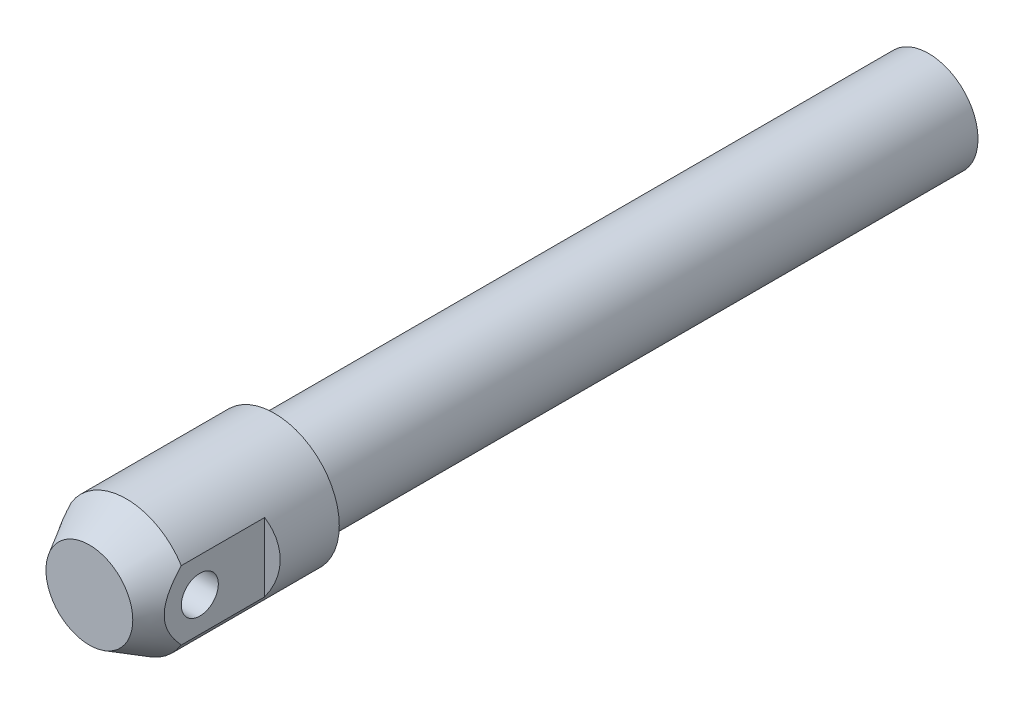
ISO-10303-21;
HEADER;
FILE_DESCRIPTION(('STEP AP214'),'2;1');
FILE_NAME('part.step','',(''),(''),'','','');
FILE_SCHEMA(('AUTOMOTIVE_DESIGN { 1 0 10303 214 1 1 1 1 }'));
ENDSEC;
DATA;
#1=APPLICATION_CONTEXT('core data for automotive mechanical design processes');
#2=APPLICATION_PROTOCOL_DEFINITION('international standard','automotive_design',2000,#1);
#3=PRODUCT_CONTEXT('',#1,'mechanical');
#4=PRODUCT('Part','Part','',(#3));
#5=PRODUCT_RELATED_PRODUCT_CATEGORY('part','',(#4));
#6=PRODUCT_DEFINITION_FORMATION('','',#4);
#7=PRODUCT_DEFINITION_CONTEXT('part definition',#1,'design');
#8=PRODUCT_DEFINITION('design','',#6,#7);
#9=PRODUCT_DEFINITION_SHAPE('','',#8);
#10=(LENGTH_UNIT() NAMED_UNIT(*) SI_UNIT(.MILLI.,.METRE.));
#11=(NAMED_UNIT(*) PLANE_ANGLE_UNIT() SI_UNIT($,.RADIAN.));
#12=(NAMED_UNIT(*) SI_UNIT($,.STERADIAN.) SOLID_ANGLE_UNIT());
#13=UNCERTAINTY_MEASURE_WITH_UNIT(LENGTH_MEASURE(1.E-05),#10,'distance_accuracy_value','');
#14=(GEOMETRIC_REPRESENTATION_CONTEXT(3) GLOBAL_UNCERTAINTY_ASSIGNED_CONTEXT((#13)) GLOBAL_UNIT_ASSIGNED_CONTEXT((#10,
#11,#12)) REPRESENTATION_CONTEXT('',''));
#15=CARTESIAN_POINT('',(0.,0.,0.));
#16=DIRECTION('',(0.,0.,1.));
#17=DIRECTION('',(1.,0.,0.));
#18=AXIS2_PLACEMENT_3D('',#15,#16,#17);
#19=CARTESIAN_POINT('',(0.,0.,20.));
#20=DIRECTION('',(0.,0.,1.));
#21=DIRECTION('',(1.,0.,0.));
#22=AXIS2_PLACEMENT_3D('',#19,#20,#21);
#23=CYLINDRICAL_SURFACE('',#22,10.5);
#24=CARTESIAN_POINT('',(0.,0.,0.));
#25=DIRECTION('',(0.,0.,1.));
#26=DIRECTION('',(1.,0.,0.));
#27=AXIS2_PLACEMENT_3D('',#24,#25,#26);
#28=CIRCLE('',#27,10.5);
#29=CARTESIAN_POINT('',(10.5,0.,0.));
#30=VERTEX_POINT('',#29);
#31=EDGE_CURVE('E82',#30,#30,#28,.T.);
#32=ORIENTED_EDGE('',*,*,#31,.T.);
#33=EDGE_LOOP('',(#32));
#34=FACE_BOUND('',#33,.T.);
#35=CARTESIAN_POINT('',(0.,0.,24.));
#36=DIRECTION('',(0.,0.,1.));
#37=DIRECTION('',(1.,0.,0.));
#38=AXIS2_PLACEMENT_3D('',#35,#36,#37);
#39=CIRCLE('',#38,10.5);
#40=CARTESIAN_POINT('',(-8.9,-5.57135531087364,24.));
#41=VERTEX_POINT('',#40);
#42=CARTESIAN_POINT('',(8.9,-5.57135531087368,24.));
#43=VERTEX_POINT('',#42);
#44=EDGE_CURVE('E67',#41,#43,#39,.T.);
#45=ORIENTED_EDGE('',*,*,#44,.F.);
#46=DIRECTION('',(0.,0.,1.));
#47=VECTOR('',#46,1.);
#48=CARTESIAN_POINT('',(-8.9,-5.57135531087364,20.));
#49=LINE('',#48,#47);
#50=CARTESIAN_POINT('',(-8.9,-5.57135531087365,10.5));
#51=VERTEX_POINT('',#50);
#52=EDGE_CURVE('E30',#41,#51,#49,.F.);
#53=ORIENTED_EDGE('',*,*,#52,.T.);
#54=CARTESIAN_POINT('',(0.,0.,15.6384173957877));
#55=DIRECTION('',(0.5,0.,-0.866025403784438));
#56=DIRECTION('',(0.866025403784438,0.,0.5));
#57=AXIS2_PLACEMENT_3D('',#54,#55,#56);
#58=ELLIPSE('',#57,12.1243556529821,10.5);
#59=CARTESIAN_POINT('',(-8.9,5.57135531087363,10.5));
#60=VERTEX_POINT('',#59);
#61=EDGE_CURVE('E9',#60,#51,#58,.F.);
#62=ORIENTED_EDGE('',*,*,#61,.F.);
#63=DIRECTION('',(0.,0.,1.));
#64=VECTOR('',#63,1.);
#65=CARTESIAN_POINT('',(-8.9,5.57135531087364,20.));
#66=LINE('',#65,#64);
#67=CARTESIAN_POINT('',(-8.9,5.57135531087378,24.));
#68=VERTEX_POINT('',#67);
#69=EDGE_CURVE('E63',#60,#68,#66,.T.);
#70=ORIENTED_EDGE('',*,*,#69,.T.);
#71=CARTESIAN_POINT('',(8.9,5.57135531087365,24.));
#72=VERTEX_POINT('',#71);
#73=EDGE_CURVE('E79',#72,#68,#39,.T.);
#74=ORIENTED_EDGE('',*,*,#73,.F.);
#75=DIRECTION('',(0.,0.,1.));
#76=VECTOR('',#75,1.);
#77=CARTESIAN_POINT('',(8.9,5.57135531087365,20.));
#78=LINE('',#77,#76);
#79=CARTESIAN_POINT('',(8.9,5.57135531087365,10.5));
#80=VERTEX_POINT('',#79);
#81=EDGE_CURVE('E38',#80,#72,#78,.T.);
#82=ORIENTED_EDGE('',*,*,#81,.F.);
#83=CARTESIAN_POINT('',(0.,0.,15.6384173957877));
#84=DIRECTION('',(0.5,0.,0.866025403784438));
#85=DIRECTION('',(-0.866025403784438,0.,0.5));
#86=AXIS2_PLACEMENT_3D('',#83,#84,#85);
#87=ELLIPSE('',#86,12.1243556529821,10.5);
#88=CARTESIAN_POINT('',(8.9,-5.57135531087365,10.5));
#89=VERTEX_POINT('',#88);
#90=EDGE_CURVE('E99',#80,#89,#87,.F.);
#91=ORIENTED_EDGE('',*,*,#90,.T.);
#92=DIRECTION('',(0.,0.,1.));
#93=VECTOR('',#92,1.);
#94=CARTESIAN_POINT('',(8.9,-5.57135531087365,20.));
#95=LINE('',#94,#93);
#96=EDGE_CURVE('E74',#43,#89,#95,.F.);
#97=ORIENTED_EDGE('',*,*,#96,.F.);
#98=EDGE_LOOP('',(#45,#53,#62,#70,#74,#82,#91,#97));
#99=FACE_BOUND('',#98,.T.);
#100=ADVANCED_FACE('F14',(#34,#99),#23,.T.);
#101=CARTESIAN_POINT('',(0.,0.,30.));
#102=DIRECTION('',(0.,0.,-1.));
#103=DIRECTION('',(-1.,0.,0.));
#104=AXIS2_PLACEMENT_3D('',#101,#102,#103);
#105=CONICAL_SURFACE('',#104,7.03589838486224,0.523598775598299);
#106=CARTESIAN_POINT('',(0.,0.,30.));
#107=DIRECTION('',(0.,0.,1.));
#108=DIRECTION('',(1.,0.,0.));
#109=AXIS2_PLACEMENT_3D('',#106,#107,#108);
#110=CIRCLE('',#109,7.03589838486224);
#111=CARTESIAN_POINT('',(7.03589838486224,0.,30.));
#112=VERTEX_POINT('',#111);
#113=EDGE_CURVE('E76',#112,#112,#110,.T.);
#114=ORIENTED_EDGE('',*,*,#113,.F.);
#115=EDGE_LOOP('',(#114));
#116=FACE_BOUND('',#115,.T.);
#117=ORIENTED_EDGE('',*,*,#73,.T.);
#118=CARTESIAN_POINT('',(-8.9,-14.6906497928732,12.4363137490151));
#119=CARTESIAN_POINT('',(-8.9,-14.3724086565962,12.9076685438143));
#120=CARTESIAN_POINT('',(-8.9,-14.0523322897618,13.3777974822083));
#121=CARTESIAN_POINT('',(-8.9,-13.407548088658,14.3149810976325));
#122=CARTESIAN_POINT('',(-8.9,-13.0828394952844,14.7820352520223));
#123=CARTESIAN_POINT('',(-8.9,-12.4255724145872,15.7156455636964));
#124=CARTESIAN_POINT('',(-8.9,-12.0929741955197,16.1821738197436));
#125=CARTESIAN_POINT('',(-8.9,-11.4209532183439,17.1102280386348));
#126=CARTESIAN_POINT('',(-8.9,-11.0815311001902,17.571754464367));
#127=CARTESIAN_POINT('',(-8.9,-10.3609340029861,18.5327258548));
#128=CARTESIAN_POINT('',(-8.9,-9.97889352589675,19.0315259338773));
#129=CARTESIAN_POINT('',(-8.9,-9.39571279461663,19.7718918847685));
#130=CARTESIAN_POINT('',(-8.9,-9.19959708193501,20.0174174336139));
#131=CARTESIAN_POINT('',(-8.9,-8.80347960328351,20.5053096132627));
#132=CARTESIAN_POINT('',(-8.9,-8.60347794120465,20.747676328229));
#133=CARTESIAN_POINT('',(-8.9,-8.19961550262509,21.2278453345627));
#134=CARTESIAN_POINT('',(-8.9,-7.99576927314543,21.4656598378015));
#135=CARTESIAN_POINT('',(-8.9,-7.58284404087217,21.9366910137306));
#136=CARTESIAN_POINT('',(-8.9,-7.37376534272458,22.1699079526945));
#137=CARTESIAN_POINT('',(-8.9,-6.94954847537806,22.6305427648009));
#138=CARTESIAN_POINT('',(-8.9,-6.7344136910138,22.8579637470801));
#139=CARTESIAN_POINT('',(-8.9,-6.29685389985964,23.3056566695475));
#140=CARTESIAN_POINT('',(-8.9,-6.0744301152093,23.5259297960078));
#141=CARTESIAN_POINT('',(-8.9,-5.72815075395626,23.8552673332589));
#142=CARTESIAN_POINT('',(-8.9,-5.60744255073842,23.967645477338));
#143=CARTESIAN_POINT('',(-8.9,-5.36335255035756,24.1894714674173));
#144=CARTESIAN_POINT('',(-8.9,-5.23997070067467,24.2989192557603));
#145=CARTESIAN_POINT('',(-8.9,-4.99019185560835,24.5144981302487));
#146=CARTESIAN_POINT('',(-8.9,-4.86379293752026,24.6206269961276));
#147=CARTESIAN_POINT('',(-8.9,-4.60777909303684,24.8289230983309));
#148=CARTESIAN_POINT('',(-8.9,-4.478164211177,24.9310903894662));
#149=CARTESIAN_POINT('',(-8.9,-4.08693511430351,25.2284953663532));
#150=CARTESIAN_POINT('',(-8.9,-3.82016647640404,25.41706407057));
#151=CARTESIAN_POINT('',(-8.9,-3.27068989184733,25.7692475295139));
#152=CARTESIAN_POINT('',(-8.9,-2.98800127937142,25.9328916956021));
#153=CARTESIAN_POINT('',(-8.9,-2.55061558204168,26.1525542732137));
#154=CARTESIAN_POINT('',(-8.9,-2.40241326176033,26.2215402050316));
#155=CARTESIAN_POINT('',(-8.9,-2.10165294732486,26.34932813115));
#156=CARTESIAN_POINT('',(-8.9,-1.94909533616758,26.4081310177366));
#157=CARTESIAN_POINT('',(-8.9,-1.64010234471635,26.5139102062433));
#158=CARTESIAN_POINT('',(-8.9,-1.48367177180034,26.5609004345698));
#159=CARTESIAN_POINT('',(-8.9,-1.16742727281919,26.6415877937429));
#160=CARTESIAN_POINT('',(-8.9,-1.00761423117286,26.6752883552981));
#161=CARTESIAN_POINT('',(-8.9,-0.683771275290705,26.7284010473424));
#162=CARTESIAN_POINT('',(-8.9,-0.519714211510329,26.747649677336));
#163=CARTESIAN_POINT('',(-8.9,-0.190509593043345,26.7703811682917));
#164=CARTESIAN_POINT('',(-8.9,-0.0253621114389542,26.7738650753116));
#165=CARTESIAN_POINT('',(-8.9,0.304423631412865,26.7649088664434));
#166=CARTESIAN_POINT('',(-8.9,0.46906208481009,26.7524757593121));
#167=CARTESIAN_POINT('',(-8.9,0.796447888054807,26.7122663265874));
#168=CARTESIAN_POINT('',(-8.9,0.959194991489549,26.684488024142));
#169=CARTESIAN_POINT('',(-8.9,1.30407432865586,26.6098776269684));
#170=CARTESIAN_POINT('',(-8.9,1.48574670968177,26.5609294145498));
#171=CARTESIAN_POINT('',(-8.9,1.84395793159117,26.4468573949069));
#172=CARTESIAN_POINT('',(-8.9,2.02049430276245,26.3817259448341));
#173=CARTESIAN_POINT('',(-8.9,2.36948052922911,26.2370400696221));
#174=CARTESIAN_POINT('',(-8.9,2.54187510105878,26.1573535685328));
#175=CARTESIAN_POINT('',(-8.9,2.88068743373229,25.9863393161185));
#176=CARTESIAN_POINT('',(-8.9,3.0471064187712,25.8950139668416));
#177=CARTESIAN_POINT('',(-8.9,3.41294088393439,25.6799946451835));
#178=CARTESIAN_POINT('',(-8.9,3.61085279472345,25.5537533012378));
#179=CARTESIAN_POINT('',(-8.9,3.99879031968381,25.2896252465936));
#180=CARTESIAN_POINT('',(-8.9,4.18881244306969,25.1517334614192));
#181=CARTESIAN_POINT('',(-8.9,4.56236330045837,24.8662868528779));
#182=CARTESIAN_POINT('',(-8.9,4.7458696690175,24.7187029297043));
#183=CARTESIAN_POINT('',(-8.9,5.10659178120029,24.4161320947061));
#184=CARTESIAN_POINT('',(-8.9,5.28380851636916,24.2611463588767));
#185=CARTESIAN_POINT('',(-8.9,5.62449488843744,23.9526465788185));
#186=CARTESIAN_POINT('',(-8.9,5.78821792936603,23.7994111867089));
#187=CARTESIAN_POINT('',(-8.9,6.11130761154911,23.4884009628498));
#188=CARTESIAN_POINT('',(-8.9,6.27067390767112,23.3306257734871));
#189=CARTESIAN_POINT('',(-8.9,6.58433981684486,23.0125301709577));
#190=CARTESIAN_POINT('',(-8.9,6.73866911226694,22.8522389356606));
#191=CARTESIAN_POINT('',(-8.9,7.04392315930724,22.5285268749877));
#192=CARTESIAN_POINT('',(-8.9,7.19484883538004,22.3651069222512));
#193=CARTESIAN_POINT('',(-8.9,7.34430663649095,22.200375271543));
#194=B_SPLINE_CURVE_WITH_KNOTS('',3,(#118,#119,#120,#121,#122,#123,#124,#125,#126,#127,#128,
#129,#130,#131,#132,#133,#134,#135,#136,#137,#138,#139,#140,#141,#142,#143,#144,#145,#146,#147,
#148,#149,#150,#151,#152,#153,#154,#155,#156,#157,#158,#159,#160,#161,#162,#163,#164,#165,#166,
#167,#168,#169,#170,#171,#172,#173,#174,#175,#176,#177,#178,#179,#180,#181,#182,#183,#184,#185,
#186,#187,#188,#189,#190,#191,#192,#193),.UNSPECIFIED.,.F.,.F.,(4,2,2,2,2,2,2,2,2,2,2,2,2,2,2,2,
2,2,2,2,2,2,2,2,2,2,2,2,2,2,2,2,2,2,2,2,2,4),(0.,1.70619901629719,3.41268092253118,
5.13147394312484,6.85010651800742,8.73479437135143,9.67747072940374,10.6201219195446,
11.5597291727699,12.4992818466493,13.4383194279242,14.3772003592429,14.8719277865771,
15.3666649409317,15.8617262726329,16.3567807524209,17.335861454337,18.3137777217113,
18.8038864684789,19.2939522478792,19.7834375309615,20.2727963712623,20.7676113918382,
21.2623935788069,21.7569579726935,22.2515860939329,22.8151573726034,23.3789953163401,
23.94822975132,24.5173468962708,25.2210484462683,25.9250580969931,26.6312877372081,
27.3374055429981,28.0100429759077,28.6827335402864,29.3502139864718,30.0175109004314),.UNSPECIFIED.);
#195=EDGE_CURVE('E23',#68,#41,#194,.F.);
#196=ORIENTED_EDGE('',*,*,#195,.T.);
#197=ORIENTED_EDGE('',*,*,#44,.T.);
#198=CARTESIAN_POINT('',(8.9,-14.6906497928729,12.4363137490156));
#199=CARTESIAN_POINT('',(8.9,-14.3724086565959,12.9076685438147));
#200=CARTESIAN_POINT('',(8.9,-14.0523322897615,13.3777974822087));
#201=CARTESIAN_POINT('',(8.9,-13.4075480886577,14.3149810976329));
#202=CARTESIAN_POINT('',(8.9,-13.0828394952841,14.7820352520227));
#203=CARTESIAN_POINT('',(8.9,-12.4255724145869,15.7156455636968));
#204=CARTESIAN_POINT('',(8.9,-12.0929741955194,16.182173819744));
#205=CARTESIAN_POINT('',(8.9,-11.4209532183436,17.1102280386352));
#206=CARTESIAN_POINT('',(8.9,-11.0815311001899,17.5717544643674));
#207=CARTESIAN_POINT('',(8.9,-10.3609340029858,18.5327258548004));
#208=CARTESIAN_POINT('',(8.9,-9.97889352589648,19.0315259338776));
#209=CARTESIAN_POINT('',(8.9,-9.39571279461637,19.7718918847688));
#210=CARTESIAN_POINT('',(8.9,-9.19959708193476,20.0174174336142));
#211=CARTESIAN_POINT('',(8.9,-8.80347960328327,20.505309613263));
#212=CARTESIAN_POINT('',(8.9,-8.60347794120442,20.7476763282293));
#213=CARTESIAN_POINT('',(8.9,-8.19961550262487,21.227845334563));
#214=CARTESIAN_POINT('',(8.9,-7.99576927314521,21.4656598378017));
#215=CARTESIAN_POINT('',(8.9,-7.58284404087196,21.9366910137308));
#216=CARTESIAN_POINT('',(8.9,-7.37376534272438,22.1699079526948));
#217=CARTESIAN_POINT('',(8.9,-6.94954847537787,22.6305427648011));
#218=CARTESIAN_POINT('',(8.9,-6.73441369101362,22.8579637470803));
#219=CARTESIAN_POINT('',(8.9,-6.29685389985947,23.3056566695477));
#220=CARTESIAN_POINT('',(8.9,-6.07443011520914,23.525929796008));
#221=CARTESIAN_POINT('',(8.9,-5.72815075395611,23.855267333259));
#222=CARTESIAN_POINT('',(8.9,-5.60744255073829,23.9676454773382));
#223=CARTESIAN_POINT('',(8.9,-5.36335255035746,24.1894714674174));
#224=CARTESIAN_POINT('',(8.9,-5.23997070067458,24.2989192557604));
#225=CARTESIAN_POINT('',(8.9,-4.99019185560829,24.5144981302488));
#226=CARTESIAN_POINT('',(8.9,-4.86379293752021,24.6206269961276));
#227=CARTESIAN_POINT('',(8.9,-4.60777909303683,24.8289230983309));
#228=CARTESIAN_POINT('',(8.9,-4.478164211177,24.9310903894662));
#229=CARTESIAN_POINT('',(8.9,-4.08693511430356,25.2284953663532));
#230=CARTESIAN_POINT('',(8.9,-3.82016647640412,25.4170640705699));
#231=CARTESIAN_POINT('',(8.9,-3.27068989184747,25.7692475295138));
#232=CARTESIAN_POINT('',(8.9,-2.98800127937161,25.932891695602));
#233=CARTESIAN_POINT('',(8.9,-2.55061558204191,26.1525542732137));
#234=CARTESIAN_POINT('',(8.9,-2.40241326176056,26.2215402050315));
#235=CARTESIAN_POINT('',(8.9,-2.10165294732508,26.34932813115));
#236=CARTESIAN_POINT('',(8.9,-1.9490953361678,26.4081310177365));
#237=CARTESIAN_POINT('',(8.9,-1.64010234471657,26.5139102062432));
#238=CARTESIAN_POINT('',(8.9,-1.48367177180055,26.5609004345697));
#239=CARTESIAN_POINT('',(8.9,-1.16742727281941,26.6415877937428));
#240=CARTESIAN_POINT('',(8.9,-1.00761423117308,26.6752883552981));
#241=CARTESIAN_POINT('',(8.9,-0.683771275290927,26.7284010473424));
#242=CARTESIAN_POINT('',(8.9,-0.519714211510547,26.747649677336));
#243=CARTESIAN_POINT('',(8.9,-0.190509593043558,26.7703811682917));
#244=CARTESIAN_POINT('',(8.9,-0.0253621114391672,26.7738650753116));
#245=CARTESIAN_POINT('',(8.9,0.304423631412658,26.7649088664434));
#246=CARTESIAN_POINT('',(8.9,0.469062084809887,26.7524757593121));
#247=CARTESIAN_POINT('',(8.9,0.796447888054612,26.7122663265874));
#248=CARTESIAN_POINT('',(8.9,0.959194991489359,26.6844880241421));
#249=CARTESIAN_POINT('',(8.9,1.30407432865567,26.6098776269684));
#250=CARTESIAN_POINT('',(8.9,1.48574670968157,26.5609294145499));
#251=CARTESIAN_POINT('',(8.9,1.84395793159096,26.446857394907));
#252=CARTESIAN_POINT('',(8.9,2.02049430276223,26.3817259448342));
#253=CARTESIAN_POINT('',(8.9,2.36948052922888,26.2370400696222));
#254=CARTESIAN_POINT('',(8.9,2.54187510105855,26.1573535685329));
#255=CARTESIAN_POINT('',(8.9,2.88068743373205,25.9863393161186));
#256=CARTESIAN_POINT('',(8.9,3.04710641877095,25.8950139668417));
#257=CARTESIAN_POINT('',(8.9,3.41294088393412,25.6799946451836));
#258=CARTESIAN_POINT('',(8.9,3.61085279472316,25.553753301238));
#259=CARTESIAN_POINT('',(8.9,3.99879031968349,25.2896252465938));
#260=CARTESIAN_POINT('',(8.9,4.18881244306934,25.1517334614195));
#261=CARTESIAN_POINT('',(8.9,4.56236330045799,24.8662868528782));
#262=CARTESIAN_POINT('',(8.9,4.7458696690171,24.7187029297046));
#263=CARTESIAN_POINT('',(8.9,5.10659178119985,24.4161320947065));
#264=CARTESIAN_POINT('',(8.9,5.28380851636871,24.2611463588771));
#265=CARTESIAN_POINT('',(8.9,5.62449488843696,23.952646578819));
#266=CARTESIAN_POINT('',(8.9,5.78821792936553,23.7994111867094));
#267=CARTESIAN_POINT('',(8.9,6.11130761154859,23.4884009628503));
#268=CARTESIAN_POINT('',(8.9,6.27067390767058,23.3306257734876));
#269=CARTESIAN_POINT('',(8.9,6.5843398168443,23.0125301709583));
#270=CARTESIAN_POINT('',(8.9,6.73866911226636,22.8522389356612));
#271=CARTESIAN_POINT('',(8.9,7.04392315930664,22.5285268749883));
#272=CARTESIAN_POINT('',(8.9,7.19484883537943,22.3651069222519));
#273=CARTESIAN_POINT('',(8.9,7.34430663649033,22.2003752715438));
#274=B_SPLINE_CURVE_WITH_KNOTS('',3,(#198,#199,#200,#201,#202,#203,#204,#205,#206,#207,#208,
#209,#210,#211,#212,#213,#214,#215,#216,#217,#218,#219,#220,#221,#222,#223,#224,#225,#226,#227,
#228,#229,#230,#231,#232,#233,#234,#235,#236,#237,#238,#239,#240,#241,#242,#243,#244,#245,#246,
#247,#248,#249,#250,#251,#252,#253,#254,#255,#256,#257,#258,#259,#260,#261,#262,#263,#264,#265,
#266,#267,#268,#269,#270,#271,#272,#273),.UNSPECIFIED.,.F.,.F.,(4,2,2,2,2,2,2,2,2,2,2,2,2,2,2,2,
2,2,2,2,2,2,2,2,2,2,2,2,2,2,2,2,2,2,2,2,2,4),(0.,1.70619901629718,3.41268092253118,
5.13147394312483,6.85010651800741,8.73479437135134,9.67747072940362,10.6201219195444,
11.5597291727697,12.4992818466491,13.4383194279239,14.3772003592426,14.8719277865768,
15.3666649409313,15.8617262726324,16.3567807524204,17.3358614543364,18.3137777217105,
18.8038864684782,19.2939522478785,19.7834375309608,20.2727963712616,20.7676113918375,
21.2623935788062,21.7569579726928,22.2515860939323,22.8151573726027,23.3789953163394,
23.9482297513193,24.51734689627,25.2210484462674,25.9250580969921,26.6312877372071,
27.337405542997,28.0100429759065,28.6827335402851,29.3502139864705,30.01751090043),.UNSPECIFIED.);
#275=EDGE_CURVE('E91',#72,#43,#274,.F.);
#276=ORIENTED_EDGE('',*,*,#275,.F.);
#277=EDGE_LOOP('',(#117,#196,#197,#276));
#278=FACE_BOUND('',#277,.T.);
#279=ADVANCED_FACE('F104',(#116,#278),#105,.T.);
#280=CARTESIAN_POINT('',(0.,7.03589838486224,30.));
#281=DIRECTION('',(0.,0.,-1.));
#282=DIRECTION('',(-1.,0.,0.));
#283=AXIS2_PLACEMENT_3D('',#280,#281,#282);
#284=PLANE('',#283);
#285=ORIENTED_EDGE('',*,*,#113,.T.);
#286=EDGE_LOOP('',(#285));
#287=FACE_BOUND('',#286,.T.);
#288=ADVANCED_FACE('F16',(#287),#284,.F.);
#289=CARTESIAN_POINT('',(0.,8.,-106.));
#290=DIRECTION('',(0.,0.,-1.));
#291=DIRECTION('',(-1.,0.,0.));
#292=AXIS2_PLACEMENT_3D('',#289,#290,#291);
#293=PLANE('',#292);
#294=CARTESIAN_POINT('',(0.,0.,-106.));
#295=DIRECTION('',(0.,0.,1.));
#296=DIRECTION('',(1.,0.,0.));
#297=AXIS2_PLACEMENT_3D('',#294,#295,#296);
#298=CIRCLE('',#297,8.);
#299=CARTESIAN_POINT('',(8.,0.,-106.));
#300=VERTEX_POINT('',#299);
#301=EDGE_CURVE('E88',#300,#300,#298,.T.);
#302=ORIENTED_EDGE('',*,*,#301,.F.);
#303=EDGE_LOOP('',(#302));
#304=FACE_BOUND('',#303,.T.);
#305=ADVANCED_FACE('F147',(#304),#293,.T.);
#306=CARTESIAN_POINT('',(0.,0.,20.));
#307=DIRECTION('',(0.,0.,1.));
#308=DIRECTION('',(1.,0.,0.));
#309=AXIS2_PLACEMENT_3D('',#306,#307,#308);
#310=CYLINDRICAL_SURFACE('',#309,8.);
#311=ORIENTED_EDGE('',*,*,#301,.T.);
#312=EDGE_LOOP('',(#311));
#313=FACE_BOUND('',#312,.T.);
#314=CARTESIAN_POINT('',(0.,0.,0.));
#315=DIRECTION('',(0.,0.,1.));
#316=DIRECTION('',(1.,0.,0.));
#317=AXIS2_PLACEMENT_3D('',#314,#315,#316);
#318=CIRCLE('',#317,8.);
#319=CARTESIAN_POINT('',(8.,0.,0.));
#320=VERTEX_POINT('',#319);
#321=EDGE_CURVE('E85',#320,#320,#318,.T.);
#322=ORIENTED_EDGE('',*,*,#321,.F.);
#323=EDGE_LOOP('',(#322));
#324=FACE_BOUND('',#323,.T.);
#325=ADVANCED_FACE('F134',(#313,#324),#310,.T.);
#326=CARTESIAN_POINT('',(0.,8.,0.));
#327=DIRECTION('',(0.,0.,1.));
#328=DIRECTION('',(1.,0.,0.));
#329=AXIS2_PLACEMENT_3D('',#326,#327,#328);
#330=PLANE('',#329);
#331=ORIENTED_EDGE('',*,*,#31,.F.);
#332=EDGE_LOOP('',(#331));
#333=FACE_BOUND('',#332,.T.);
#334=ORIENTED_EDGE('',*,*,#321,.T.);
#335=EDGE_LOOP('',(#334));
#336=FACE_BOUND('',#335,.T.);
#337=ADVANCED_FACE('F125',(#333,#336),#330,.F.);
#338=CARTESIAN_POINT('',(8.9,-15.,10.5));
#339=DIRECTION('',(0.5,0.,0.866025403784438));
#340=DIRECTION('',(0.866025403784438,0.,-0.5));
#341=AXIS2_PLACEMENT_3D('',#338,#339,#340);
#342=PLANE('',#341);
#343=DIRECTION('',(0.,1.,0.));
#344=VECTOR('',#343,1.);
#345=CARTESIAN_POINT('',(8.9,-15.,10.5));
#346=LINE('',#345,#344);
#347=EDGE_CURVE('E68',#89,#80,#346,.T.);
#348=ORIENTED_EDGE('',*,*,#347,.F.);
#349=ORIENTED_EDGE('',*,*,#90,.F.);
#350=EDGE_LOOP('',(#348,#349));
#351=FACE_BOUND('',#350,.T.);
#352=ADVANCED_FACE('F123',(#351),#342,.T.);
#353=CARTESIAN_POINT('',(8.9,-15.,10.5));
#354=DIRECTION('',(-1.,0.,0.));
#355=DIRECTION('',(0.,0.,1.));
#356=AXIS2_PLACEMENT_3D('',#353,#354,#355);
#357=PLANE('',#356);
#358=CARTESIAN_POINT('',(8.9,0.,21.));
#359=DIRECTION('',(1.,0.,0.));
#360=DIRECTION('',(0.,0.,-1.));
#361=AXIS2_PLACEMENT_3D('',#358,#359,#360);
#362=CIRCLE('',#361,3.);
#363=CARTESIAN_POINT('',(8.9,0.,18.));
#364=VERTEX_POINT('',#363);
#365=EDGE_CURVE('E233',#364,#364,#362,.T.);
#366=ORIENTED_EDGE('',*,*,#365,.F.);
#367=EDGE_LOOP('',(#366));
#368=FACE_BOUND('',#367,.T.);
#369=ORIENTED_EDGE('',*,*,#96,.T.);
#370=ORIENTED_EDGE('',*,*,#347,.T.);
#371=ORIENTED_EDGE('',*,*,#81,.T.);
#372=ORIENTED_EDGE('',*,*,#275,.T.);
#373=EDGE_LOOP('',(#369,#370,#371,#372));
#374=FACE_BOUND('',#373,.T.);
#375=ADVANCED_FACE('F101',(#368,#374),#357,.F.);
#376=CARTESIAN_POINT('',(-8.9,-15.,10.5));
#377=DIRECTION('',(-1.,0.,0.));
#378=DIRECTION('',(0.,0.,1.));
#379=AXIS2_PLACEMENT_3D('',#376,#377,#378);
#380=PLANE('',#379);
#381=CARTESIAN_POINT('',(-8.9,0.,21.));
#382=DIRECTION('',(-1.,0.,0.));
#383=DIRECTION('',(0.,0.,1.));
#384=AXIS2_PLACEMENT_3D('',#381,#382,#383);
#385=CIRCLE('',#384,3.);
#386=CARTESIAN_POINT('',(-8.9,0.,24.));
#387=VERTEX_POINT('',#386);
#388=EDGE_CURVE('E18',#387,#387,#385,.T.);
#389=ORIENTED_EDGE('',*,*,#388,.F.);
#390=EDGE_LOOP('',(#389));
#391=FACE_BOUND('',#390,.T.);
#392=ORIENTED_EDGE('',*,*,#195,.F.);
#393=ORIENTED_EDGE('',*,*,#69,.F.);
#394=DIRECTION('',(0.,1.,0.));
#395=VECTOR('',#394,1.);
#396=CARTESIAN_POINT('',(-8.9,-15.,10.5));
#397=LINE('',#396,#395);
#398=EDGE_CURVE('E59',#51,#60,#397,.T.);
#399=ORIENTED_EDGE('',*,*,#398,.F.);
#400=ORIENTED_EDGE('',*,*,#52,.F.);
#401=EDGE_LOOP('',(#392,#393,#399,#400));
#402=FACE_BOUND('',#401,.T.);
#403=ADVANCED_FACE('F62',(#391,#402),#380,.T.);
#404=CARTESIAN_POINT('',(-8.9,-15.,10.5));
#405=DIRECTION('',(0.5,0.,-0.866025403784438));
#406=DIRECTION('',(-0.866025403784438,0.,-0.5));
#407=AXIS2_PLACEMENT_3D('',#404,#405,#406);
#408=PLANE('',#407);
#409=ORIENTED_EDGE('',*,*,#61,.T.);
#410=ORIENTED_EDGE('',*,*,#398,.T.);
#411=EDGE_LOOP('',(#409,#410));
#412=FACE_BOUND('',#411,.T.);
#413=ADVANCED_FACE('F58',(#412),#408,.F.);
#414=CARTESIAN_POINT('',(-10.5,0.,21.));
#415=DIRECTION('',(1.,0.,0.));
#416=DIRECTION('',(0.,0.,-1.));
#417=AXIS2_PLACEMENT_3D('',#414,#415,#416);
#418=CYLINDRICAL_SURFACE('',#417,3.);
#419=ORIENTED_EDGE('',*,*,#388,.T.);
#420=EDGE_LOOP('',(#419));
#421=FACE_BOUND('',#420,.T.);
#422=ORIENTED_EDGE('',*,*,#365,.T.);
#423=EDGE_LOOP('',(#422));
#424=FACE_BOUND('',#423,.T.);
#425=ADVANCED_FACE('F121',(#421,#424),#418,.F.);
#426=CLOSED_SHELL('',(#100,#279,#288,#305,#325,#337,#352,#375,#403,#413,#425));
#427=MANIFOLD_SOLID_BREP('B1',#426);
#428=ADVANCED_BREP_SHAPE_REPRESENTATION('',(#18,#427),#14);
#429=SHAPE_DEFINITION_REPRESENTATION(#9,#428);
ENDSEC;
END-ISO-10303-21;
